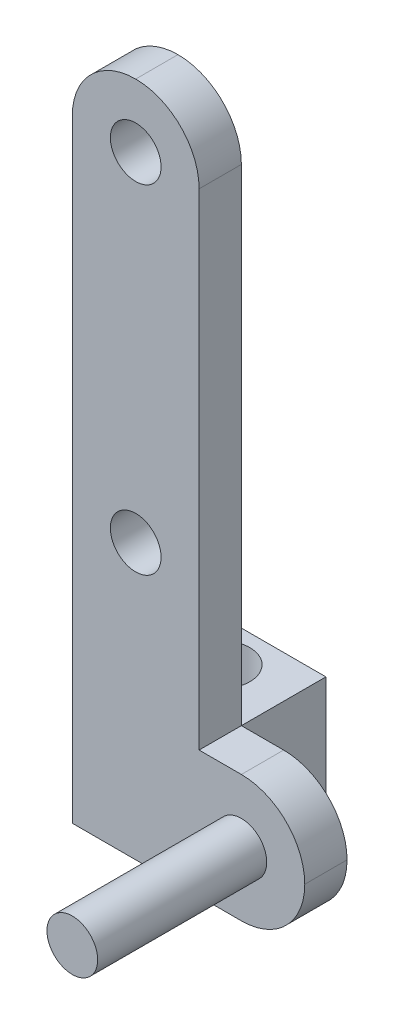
ISO-10303-21;
HEADER;
FILE_DESCRIPTION(('STEP AP214'),'2;1');
FILE_NAME('part.step','',(''),(''),'','','');
FILE_SCHEMA(('AUTOMOTIVE_DESIGN { 1 0 10303 214 1 1 1 1 }'));
ENDSEC;
DATA;
#1=APPLICATION_CONTEXT('core data for automotive mechanical design processes');
#2=APPLICATION_PROTOCOL_DEFINITION('international standard','automotive_design',2000,#1);
#3=PRODUCT_CONTEXT('',#1,'mechanical');
#4=PRODUCT('Part','Part','',(#3));
#5=PRODUCT_RELATED_PRODUCT_CATEGORY('part','',(#4));
#6=PRODUCT_DEFINITION_FORMATION('','',#4);
#7=PRODUCT_DEFINITION_CONTEXT('part definition',#1,'design');
#8=PRODUCT_DEFINITION('design','',#6,#7);
#9=PRODUCT_DEFINITION_SHAPE('','',#8);
#10=(LENGTH_UNIT() NAMED_UNIT(*) SI_UNIT(.MILLI.,.METRE.));
#11=(NAMED_UNIT(*) PLANE_ANGLE_UNIT() SI_UNIT($,.RADIAN.));
#12=(NAMED_UNIT(*) SI_UNIT($,.STERADIAN.) SOLID_ANGLE_UNIT());
#13=UNCERTAINTY_MEASURE_WITH_UNIT(LENGTH_MEASURE(1.E-05),#10,'distance_accuracy_value','');
#14=(GEOMETRIC_REPRESENTATION_CONTEXT(3) GLOBAL_UNCERTAINTY_ASSIGNED_CONTEXT((#13)) GLOBAL_UNIT_ASSIGNED_CONTEXT((#10,
#11,#12)) REPRESENTATION_CONTEXT('',''));
#15=CARTESIAN_POINT('',(0.,0.,0.));
#16=DIRECTION('',(0.,0.,1.));
#17=DIRECTION('',(1.,0.,0.));
#18=AXIS2_PLACEMENT_3D('',#15,#16,#17);
#19=CARTESIAN_POINT('',(-30.,0.,0.));
#20=DIRECTION('',(0.,0.,-1.));
#21=DIRECTION('',(-1.,0.,0.));
#22=AXIS2_PLACEMENT_3D('',#19,#20,#21);
#23=PLANE('',#22);
#24=CARTESIAN_POINT('',(-15.,-95.,0.));
#25=DIRECTION('',(0.,0.,-1.));
#26=DIRECTION('',(-1.,0.,0.));
#27=AXIS2_PLACEMENT_3D('',#24,#25,#26);
#28=CIRCLE('',#27,6.);
#29=CARTESIAN_POINT('',(-21.,-95.,0.));
#30=VERTEX_POINT('',#29);
#31=EDGE_CURVE('E196',#30,#30,#28,.T.);
#32=ORIENTED_EDGE('',*,*,#31,.F.);
#33=EDGE_LOOP('',(#32));
#34=FACE_BOUND('',#33,.T.);
#35=CARTESIAN_POINT('',(-15.,-15.,0.));
#36=DIRECTION('',(0.,0.,-1.));
#37=DIRECTION('',(-1.,0.,0.));
#38=AXIS2_PLACEMENT_3D('',#35,#36,#37);
#39=CIRCLE('',#38,6.);
#40=CARTESIAN_POINT('',(-21.,-15.,0.));
#41=VERTEX_POINT('',#40);
#42=EDGE_CURVE('E202',#41,#41,#39,.T.);
#43=ORIENTED_EDGE('',*,*,#42,.F.);
#44=EDGE_LOOP('',(#43));
#45=FACE_BOUND('',#44,.T.);
#46=DIRECTION('',(0.,-1.,0.));
#47=VECTOR('',#46,1.);
#48=CARTESIAN_POINT('',(-30.,0.,0.));
#49=LINE('',#48,#47);
#50=CARTESIAN_POINT('',(-30.,-15.,0.));
#51=VERTEX_POINT('',#50);
#52=CARTESIAN_POINT('',(-30.,-130.,0.));
#53=VERTEX_POINT('',#52);
#54=EDGE_CURVE('E142',#51,#53,#49,.T.);
#55=ORIENTED_EDGE('',*,*,#54,.F.);
#56=CARTESIAN_POINT('',(-15.,-15.,0.));
#57=DIRECTION('',(0.,0.,-1.));
#58=DIRECTION('',(-1.,0.,0.));
#59=AXIS2_PLACEMENT_3D('',#56,#57,#58);
#60=CIRCLE('',#59,15.);
#61=CARTESIAN_POINT('',(-15.,0.,0.));
#62=VERTEX_POINT('',#61);
#63=EDGE_CURVE('E42',#51,#62,#60,.T.);
#64=ORIENTED_EDGE('',*,*,#63,.T.);
#65=CARTESIAN_POINT('',(-15.,-15.,0.));
#66=DIRECTION('',(0.,0.,-1.));
#67=DIRECTION('',(-1.,0.,0.));
#68=AXIS2_PLACEMENT_3D('',#65,#66,#67);
#69=CIRCLE('',#68,15.);
#70=CARTESIAN_POINT('',(0.,-15.,0.));
#71=VERTEX_POINT('',#70);
#72=EDGE_CURVE('E50',#62,#71,#69,.T.);
#73=ORIENTED_EDGE('',*,*,#72,.T.);
#74=DIRECTION('',(0.,1.,0.));
#75=VECTOR('',#74,1.);
#76=CARTESIAN_POINT('',(0.,0.,0.));
#77=LINE('',#76,#75);
#78=CARTESIAN_POINT('',(0.,-130.,0.));
#79=VERTEX_POINT('',#78);
#80=EDGE_CURVE('E153',#79,#71,#77,.T.);
#81=ORIENTED_EDGE('',*,*,#80,.F.);
#82=DIRECTION('',(1.,0.,0.));
#83=VECTOR('',#82,1.);
#84=CARTESIAN_POINT('',(-30.,-130.,0.));
#85=LINE('',#84,#83);
#86=EDGE_CURVE('E138',#53,#79,#85,.T.);
#87=ORIENTED_EDGE('',*,*,#86,.F.);
#88=EDGE_LOOP('',(#55,#64,#73,#81,#87));
#89=FACE_BOUND('',#88,.T.);
#90=ADVANCED_FACE('F33',(#34,#45,#89),#23,.T.);
#91=CARTESIAN_POINT('',(-30.,0.,10.));
#92=DIRECTION('',(0.,0.,-1.));
#93=DIRECTION('',(-1.,0.,0.));
#94=AXIS2_PLACEMENT_3D('',#91,#92,#93);
#95=PLANE('',#94);
#96=CARTESIAN_POINT('',(-15.,-95.,10.));
#97=DIRECTION('',(0.,0.,1.));
#98=DIRECTION('',(1.,0.,0.));
#99=AXIS2_PLACEMENT_3D('',#96,#97,#98);
#100=CIRCLE('',#99,6.);
#101=CARTESIAN_POINT('',(-8.99999999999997,-95.,10.));
#102=VERTEX_POINT('',#101);
#103=EDGE_CURVE('E179',#102,#102,#100,.T.);
#104=ORIENTED_EDGE('',*,*,#103,.F.);
#105=EDGE_LOOP('',(#104));
#106=FACE_BOUND('',#105,.T.);
#107=CARTESIAN_POINT('',(-15.,-15.,10.));
#108=DIRECTION('',(0.,0.,1.));
#109=DIRECTION('',(1.,0.,0.));
#110=AXIS2_PLACEMENT_3D('',#107,#108,#109);
#111=CIRCLE('',#110,6.);
#112=CARTESIAN_POINT('',(-8.99999999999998,-15.,10.));
#113=VERTEX_POINT('',#112);
#114=EDGE_CURVE('E199',#113,#113,#111,.T.);
#115=ORIENTED_EDGE('',*,*,#114,.F.);
#116=EDGE_LOOP('',(#115));
#117=FACE_BOUND('',#116,.T.);
#118=DIRECTION('',(1.,0.,0.));
#119=VECTOR('',#118,1.);
#120=CARTESIAN_POINT('',(25.,-160.,10.));
#121=LINE('',#120,#119);
#122=CARTESIAN_POINT('',(-30.,-160.,10.));
#123=VERTEX_POINT('',#122);
#124=CARTESIAN_POINT('',(10.,-160.,10.));
#125=VERTEX_POINT('',#124);
#126=EDGE_CURVE('E152',#123,#125,#121,.T.);
#127=ORIENTED_EDGE('',*,*,#126,.T.);
#128=CARTESIAN_POINT('',(10.,-145.,10.));
#129=DIRECTION('',(0.,0.,-1.));
#130=DIRECTION('',(-1.,0.,0.));
#131=AXIS2_PLACEMENT_3D('',#128,#129,#130);
#132=CIRCLE('',#131,15.);
#133=CARTESIAN_POINT('',(25.,-145.,10.));
#134=VERTEX_POINT('',#133);
#135=EDGE_CURVE('E225',#125,#134,#132,.F.);
#136=ORIENTED_EDGE('',*,*,#135,.T.);
#137=CARTESIAN_POINT('',(10.,-145.,10.));
#138=DIRECTION('',(0.,0.,-1.));
#139=DIRECTION('',(-1.,0.,0.));
#140=AXIS2_PLACEMENT_3D('',#137,#138,#139);
#141=CIRCLE('',#140,15.);
#142=CARTESIAN_POINT('',(10.,-130.,10.));
#143=VERTEX_POINT('',#142);
#144=EDGE_CURVE('E224',#134,#143,#141,.F.);
#145=ORIENTED_EDGE('',*,*,#144,.T.);
#146=DIRECTION('',(-1.,0.,0.));
#147=VECTOR('',#146,1.);
#148=CARTESIAN_POINT('',(0.,-130.,10.));
#149=LINE('',#148,#147);
#150=CARTESIAN_POINT('',(0.,-130.,10.));
#151=VERTEX_POINT('',#150);
#152=EDGE_CURVE('E156',#143,#151,#149,.T.);
#153=ORIENTED_EDGE('',*,*,#152,.T.);
#154=DIRECTION('',(0.,1.,0.));
#155=VECTOR('',#154,1.);
#156=CARTESIAN_POINT('',(0.,0.,10.));
#157=LINE('',#156,#155);
#158=CARTESIAN_POINT('',(0.,-15.,10.));
#159=VERTEX_POINT('',#158);
#160=EDGE_CURVE('E158',#151,#159,#157,.T.);
#161=ORIENTED_EDGE('',*,*,#160,.T.);
#162=CARTESIAN_POINT('',(-15.,-15.,10.));
#163=DIRECTION('',(0.,0.,-1.));
#164=DIRECTION('',(-1.,0.,0.));
#165=AXIS2_PLACEMENT_3D('',#162,#163,#164);
#166=CIRCLE('',#165,15.);
#167=CARTESIAN_POINT('',(-15.,0.,10.));
#168=VERTEX_POINT('',#167);
#169=EDGE_CURVE('E220',#159,#168,#166,.F.);
#170=ORIENTED_EDGE('',*,*,#169,.T.);
#171=CARTESIAN_POINT('',(-15.,-15.,10.));
#172=DIRECTION('',(0.,0.,-1.));
#173=DIRECTION('',(-1.,0.,0.));
#174=AXIS2_PLACEMENT_3D('',#171,#172,#173);
#175=CIRCLE('',#174,15.);
#176=CARTESIAN_POINT('',(-30.,-15.,10.));
#177=VERTEX_POINT('',#176);
#178=EDGE_CURVE('E222',#168,#177,#175,.F.);
#179=ORIENTED_EDGE('',*,*,#178,.T.);
#180=DIRECTION('',(0.,-1.,0.));
#181=VECTOR('',#180,1.);
#182=CARTESIAN_POINT('',(-30.,0.,10.));
#183=LINE('',#182,#181);
#184=EDGE_CURVE('E150',#177,#123,#183,.T.);
#185=ORIENTED_EDGE('',*,*,#184,.T.);
#186=EDGE_LOOP('',(#127,#136,#145,#153,#161,#170,#179,#185));
#187=FACE_BOUND('',#186,.T.);
#188=CARTESIAN_POINT('',(10.,-145.,10.));
#189=DIRECTION('',(0.,0.,-1.));
#190=DIRECTION('',(-1.,0.,0.));
#191=AXIS2_PLACEMENT_3D('',#188,#189,#190);
#192=CIRCLE('',#191,6.);
#193=CARTESIAN_POINT('',(4.00000000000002,-145.,10.));
#194=VERTEX_POINT('',#193);
#195=EDGE_CURVE('E215',#194,#194,#192,.F.);
#196=ORIENTED_EDGE('',*,*,#195,.F.);
#197=EDGE_LOOP('',(#196));
#198=FACE_BOUND('',#197,.T.);
#199=ADVANCED_FACE('F267',(#106,#117,#187,#198),#95,.F.);
#200=CARTESIAN_POINT('',(-30.,0.,10.));
#201=DIRECTION('',(1.,0.,0.));
#202=DIRECTION('',(0.,1.,0.));
#203=AXIS2_PLACEMENT_3D('',#200,#201,#202);
#204=PLANE('',#203);
#205=ORIENTED_EDGE('',*,*,#184,.F.);
#206=DIRECTION('',(0.,0.,-1.));
#207=VECTOR('',#206,1.);
#208=CARTESIAN_POINT('',(-30.,-15.,10.));
#209=LINE('',#208,#207);
#210=EDGE_CURVE('E172',#177,#51,#209,.T.);
#211=ORIENTED_EDGE('',*,*,#210,.T.);
#212=ORIENTED_EDGE('',*,*,#54,.T.);
#213=DIRECTION('',(0.,0.,1.));
#214=VECTOR('',#213,1.);
#215=CARTESIAN_POINT('',(-30.,-130.,-20.));
#216=LINE('',#215,#214);
#217=CARTESIAN_POINT('',(-30.,-130.,-20.));
#218=VERTEX_POINT('',#217);
#219=EDGE_CURVE('E144',#218,#53,#216,.T.);
#220=ORIENTED_EDGE('',*,*,#219,.F.);
#221=DIRECTION('',(0.,1.,0.));
#222=VECTOR('',#221,1.);
#223=CARTESIAN_POINT('',(-30.,-160.,-20.));
#224=LINE('',#223,#222);
#225=CARTESIAN_POINT('',(-30.,-160.,-20.));
#226=VERTEX_POINT('',#225);
#227=EDGE_CURVE('E130',#226,#218,#224,.T.);
#228=ORIENTED_EDGE('',*,*,#227,.F.);
#229=DIRECTION('',(0.,0.,-1.));
#230=VECTOR('',#229,1.);
#231=CARTESIAN_POINT('',(-30.,-160.,10.));
#232=LINE('',#231,#230);
#233=EDGE_CURVE('E258',#123,#226,#232,.T.);
#234=ORIENTED_EDGE('',*,*,#233,.F.);
#235=EDGE_LOOP('',(#205,#211,#212,#220,#228,#234));
#236=FACE_BOUND('',#235,.T.);
#237=ADVANCED_FACE('F273',(#236),#204,.F.);
#238=CARTESIAN_POINT('',(25.,-160.,10.));
#239=DIRECTION('',(0.,1.,0.));
#240=DIRECTION('',(0.,0.,1.));
#241=AXIS2_PLACEMENT_3D('',#238,#239,#240);
#242=PLANE('',#241);
#243=CARTESIAN_POINT('',(-15.,-160.,-10.));
#244=DIRECTION('',(0.,1.,0.));
#245=DIRECTION('',(0.,0.,1.));
#246=AXIS2_PLACEMENT_3D('',#243,#244,#245);
#247=CIRCLE('',#246,6.99999999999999);
#248=CARTESIAN_POINT('',(-15.,-160.,-3.00000000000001));
#249=VERTEX_POINT('',#248);
#250=EDGE_CURVE('E37',#249,#249,#247,.T.);
#251=ORIENTED_EDGE('',*,*,#250,.T.);
#252=EDGE_LOOP('',(#251));
#253=FACE_BOUND('',#252,.T.);
#254=DIRECTION('',(1.,0.,0.));
#255=VECTOR('',#254,1.);
#256=CARTESIAN_POINT('',(25.,-160.,0.));
#257=LINE('',#256,#255);
#258=CARTESIAN_POINT('',(0.,-160.,0.));
#259=VERTEX_POINT('',#258);
#260=CARTESIAN_POINT('',(10.,-160.,0.));
#261=VERTEX_POINT('',#260);
#262=EDGE_CURVE('E169',#259,#261,#257,.T.);
#263=ORIENTED_EDGE('',*,*,#262,.T.);
#264=DIRECTION('',(0.,0.,-1.));
#265=VECTOR('',#264,1.);
#266=CARTESIAN_POINT('',(10.,-160.,10.));
#267=LINE('',#266,#265);
#268=EDGE_CURVE('E217',#261,#125,#267,.F.);
#269=ORIENTED_EDGE('',*,*,#268,.T.);
#270=ORIENTED_EDGE('',*,*,#126,.F.);
#271=ORIENTED_EDGE('',*,*,#233,.T.);
#272=DIRECTION('',(-1.,0.,0.));
#273=VECTOR('',#272,1.);
#274=CARTESIAN_POINT('',(0.,-160.,-20.));
#275=LINE('',#274,#273);
#276=CARTESIAN_POINT('',(0.,-160.,-20.));
#277=VERTEX_POINT('',#276);
#278=EDGE_CURVE('E124',#277,#226,#275,.T.);
#279=ORIENTED_EDGE('',*,*,#278,.F.);
#280=DIRECTION('',(0.,0.,1.));
#281=VECTOR('',#280,1.);
#282=CARTESIAN_POINT('',(0.,-160.,-20.));
#283=LINE('',#282,#281);
#284=EDGE_CURVE('E120',#277,#259,#283,.T.);
#285=ORIENTED_EDGE('',*,*,#284,.T.);
#286=EDGE_LOOP('',(#263,#269,#270,#271,#279,#285));
#287=FACE_BOUND('',#286,.T.);
#288=ADVANCED_FACE('F249',(#253,#287),#242,.F.);
#289=CARTESIAN_POINT('',(0.,-130.,10.));
#290=DIRECTION('',(0.,-1.,0.));
#291=DIRECTION('',(0.,0.,-1.));
#292=AXIS2_PLACEMENT_3D('',#289,#290,#291);
#293=PLANE('',#292);
#294=ORIENTED_EDGE('',*,*,#152,.F.);
#295=DIRECTION('',(0.,0.,-1.));
#296=VECTOR('',#295,1.);
#297=CARTESIAN_POINT('',(10.,-130.,10.));
#298=LINE('',#297,#296);
#299=CARTESIAN_POINT('',(10.,-130.,0.));
#300=VERTEX_POINT('',#299);
#301=EDGE_CURVE('E170',#143,#300,#298,.T.);
#302=ORIENTED_EDGE('',*,*,#301,.T.);
#303=DIRECTION('',(-1.,0.,0.));
#304=VECTOR('',#303,1.);
#305=CARTESIAN_POINT('',(0.,-130.,0.));
#306=LINE('',#305,#304);
#307=EDGE_CURVE('E234',#300,#79,#306,.T.);
#308=ORIENTED_EDGE('',*,*,#307,.T.);
#309=DIRECTION('',(0.,0.,-1.));
#310=VECTOR('',#309,1.);
#311=CARTESIAN_POINT('',(0.,-130.,10.));
#312=LINE('',#311,#310);
#313=EDGE_CURVE('E161',#151,#79,#312,.T.);
#314=ORIENTED_EDGE('',*,*,#313,.F.);
#315=EDGE_LOOP('',(#294,#302,#308,#314));
#316=FACE_BOUND('',#315,.T.);
#317=ADVANCED_FACE('F232',(#316),#293,.F.);
#318=CARTESIAN_POINT('',(0.,0.,10.));
#319=DIRECTION('',(-1.,0.,0.));
#320=DIRECTION('',(0.,-1.,0.));
#321=AXIS2_PLACEMENT_3D('',#318,#319,#320);
#322=PLANE('',#321);
#323=ORIENTED_EDGE('',*,*,#80,.T.);
#324=DIRECTION('',(0.,0.,-1.));
#325=VECTOR('',#324,1.);
#326=CARTESIAN_POINT('',(0.,-15.,10.));
#327=LINE('',#326,#325);
#328=EDGE_CURVE('E11',#71,#159,#327,.F.);
#329=ORIENTED_EDGE('',*,*,#328,.T.);
#330=ORIENTED_EDGE('',*,*,#160,.F.);
#331=ORIENTED_EDGE('',*,*,#313,.T.);
#332=EDGE_LOOP('',(#323,#329,#330,#331));
#333=FACE_BOUND('',#332,.T.);
#334=ADVANCED_FACE('F263',(#333),#322,.F.);
#335=CARTESIAN_POINT('',(10.,-145.,0.));
#336=DIRECTION('',(0.,0.,-1.));
#337=DIRECTION('',(-1.,0.,0.));
#338=AXIS2_PLACEMENT_3D('',#335,#336,#337);
#339=CIRCLE('',#338,15.);
#340=CARTESIAN_POINT('',(25.,-145.,0.));
#341=VERTEX_POINT('',#340);
#342=EDGE_CURVE('E212',#300,#341,#339,.T.);
#343=ORIENTED_EDGE('',*,*,#342,.T.);
#344=CARTESIAN_POINT('',(10.,-145.,0.));
#345=DIRECTION('',(0.,0.,-1.));
#346=DIRECTION('',(-1.,0.,0.));
#347=AXIS2_PLACEMENT_3D('',#344,#345,#346);
#348=CIRCLE('',#347,15.);
#349=EDGE_CURVE('E214',#341,#261,#348,.T.);
#350=ORIENTED_EDGE('',*,*,#349,.T.);
#351=ORIENTED_EDGE('',*,*,#262,.F.);
#352=DIRECTION('',(0.,-1.,0.));
#353=VECTOR('',#352,1.);
#354=CARTESIAN_POINT('',(0.,-130.,0.));
#355=LINE('',#354,#353);
#356=EDGE_CURVE('E134',#79,#259,#355,.T.);
#357=ORIENTED_EDGE('',*,*,#356,.F.);
#358=ORIENTED_EDGE('',*,*,#307,.F.);
#359=EDGE_LOOP('',(#343,#350,#351,#357,#358));
#360=FACE_BOUND('',#359,.T.);
#361=ADVANCED_FACE('F239',(#360),#23,.T.);
#362=CARTESIAN_POINT('',(10.,-145.,50.));
#363=DIRECTION('',(0.,0.,-1.));
#364=DIRECTION('',(-1.,0.,0.));
#365=AXIS2_PLACEMENT_3D('',#362,#363,#364);
#366=CYLINDRICAL_SURFACE('',#365,6.);
#367=CARTESIAN_POINT('',(10.,-145.,50.));
#368=DIRECTION('',(0.,0.,1.));
#369=DIRECTION('',(1.,0.,0.));
#370=AXIS2_PLACEMENT_3D('',#367,#368,#369);
#371=CIRCLE('',#370,6.);
#372=CARTESIAN_POINT('',(16.,-145.,50.));
#373=VERTEX_POINT('',#372);
#374=EDGE_CURVE('E139',#373,#373,#371,.T.);
#375=ORIENTED_EDGE('',*,*,#374,.F.);
#376=EDGE_LOOP('',(#375));
#377=FACE_BOUND('',#376,.T.);
#378=ORIENTED_EDGE('',*,*,#195,.T.);
#379=EDGE_LOOP('',(#378));
#380=FACE_BOUND('',#379,.T.);
#381=ADVANCED_FACE('F295',(#377,#380),#366,.T.);
#382=CARTESIAN_POINT('',(10.,-145.,50.));
#383=DIRECTION('',(0.,0.,1.));
#384=DIRECTION('',(1.,0.,0.));
#385=AXIS2_PLACEMENT_3D('',#382,#383,#384);
#386=PLANE('',#385);
#387=ORIENTED_EDGE('',*,*,#374,.T.);
#388=EDGE_LOOP('',(#387));
#389=FACE_BOUND('',#388,.T.);
#390=ADVANCED_FACE('F300',(#389),#386,.T.);
#391=CARTESIAN_POINT('',(-30.,-130.,-20.));
#392=DIRECTION('',(0.,-1.,0.));
#393=DIRECTION('',(0.,0.,-1.));
#394=AXIS2_PLACEMENT_3D('',#391,#392,#393);
#395=PLANE('',#394);
#396=CARTESIAN_POINT('',(-15.,-130.,-10.));
#397=DIRECTION('',(0.,1.,0.));
#398=DIRECTION('',(0.,0.,1.));
#399=AXIS2_PLACEMENT_3D('',#396,#397,#398);
#400=CIRCLE('',#399,6.99999999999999);
#401=CARTESIAN_POINT('',(-15.,-130.,-3.00000000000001));
#402=VERTEX_POINT('',#401);
#403=EDGE_CURVE('E186',#402,#402,#400,.T.);
#404=ORIENTED_EDGE('',*,*,#403,.F.);
#405=EDGE_LOOP('',(#404));
#406=FACE_BOUND('',#405,.T.);
#407=ORIENTED_EDGE('',*,*,#86,.T.);
#408=DIRECTION('',(0.,0.,1.));
#409=VECTOR('',#408,1.);
#410=CARTESIAN_POINT('',(0.,-130.,-20.));
#411=LINE('',#410,#409);
#412=CARTESIAN_POINT('',(0.,-130.,-20.));
#413=VERTEX_POINT('',#412);
#414=EDGE_CURVE('E117',#413,#79,#411,.T.);
#415=ORIENTED_EDGE('',*,*,#414,.F.);
#416=DIRECTION('',(1.,0.,0.));
#417=VECTOR('',#416,1.);
#418=CARTESIAN_POINT('',(-30.,-130.,-20.));
#419=LINE('',#418,#417);
#420=EDGE_CURVE('E125',#218,#413,#419,.T.);
#421=ORIENTED_EDGE('',*,*,#420,.F.);
#422=ORIENTED_EDGE('',*,*,#219,.T.);
#423=EDGE_LOOP('',(#407,#415,#421,#422));
#424=FACE_BOUND('',#423,.T.);
#425=ADVANCED_FACE('F136',(#406,#424),#395,.F.);
#426=CARTESIAN_POINT('',(0.,-130.,-20.));
#427=DIRECTION('',(-1.,0.,0.));
#428=DIRECTION('',(0.,-1.,0.));
#429=AXIS2_PLACEMENT_3D('',#426,#427,#428);
#430=PLANE('',#429);
#431=ORIENTED_EDGE('',*,*,#356,.T.);
#432=ORIENTED_EDGE('',*,*,#284,.F.);
#433=DIRECTION('',(0.,-1.,0.));
#434=VECTOR('',#433,1.);
#435=CARTESIAN_POINT('',(0.,-130.,-20.));
#436=LINE('',#435,#434);
#437=EDGE_CURVE('E112',#413,#277,#436,.T.);
#438=ORIENTED_EDGE('',*,*,#437,.F.);
#439=ORIENTED_EDGE('',*,*,#414,.T.);
#440=EDGE_LOOP('',(#431,#432,#438,#439));
#441=FACE_BOUND('',#440,.T.);
#442=ADVANCED_FACE('F115',(#441),#430,.F.);
#443=CARTESIAN_POINT('',(0.,-130.,-20.));
#444=DIRECTION('',(0.,0.,-1.));
#445=DIRECTION('',(-1.,0.,0.));
#446=AXIS2_PLACEMENT_3D('',#443,#444,#445);
#447=PLANE('',#446);
#448=ORIENTED_EDGE('',*,*,#420,.T.);
#449=ORIENTED_EDGE('',*,*,#437,.T.);
#450=ORIENTED_EDGE('',*,*,#278,.T.);
#451=ORIENTED_EDGE('',*,*,#227,.T.);
#452=EDGE_LOOP('',(#448,#449,#450,#451));
#453=FACE_BOUND('',#452,.T.);
#454=ADVANCED_FACE('F128',(#453),#447,.T.);
#455=CARTESIAN_POINT('',(-15.,-15.,-20.000025));
#456=DIRECTION('',(0.,0.,1.));
#457=DIRECTION('',(1.,0.,0.));
#458=AXIS2_PLACEMENT_3D('',#455,#456,#457);
#459=CYLINDRICAL_SURFACE('',#458,6.);
#460=ORIENTED_EDGE('',*,*,#42,.T.);
#461=EDGE_LOOP('',(#460));
#462=FACE_BOUND('',#461,.T.);
#463=ORIENTED_EDGE('',*,*,#114,.T.);
#464=EDGE_LOOP('',(#463));
#465=FACE_BOUND('',#464,.T.);
#466=ADVANCED_FACE('F318',(#462,#465),#459,.F.);
#467=CARTESIAN_POINT('',(-15.,-95.,-20.000025));
#468=DIRECTION('',(0.,0.,1.));
#469=DIRECTION('',(1.,0.,0.));
#470=AXIS2_PLACEMENT_3D('',#467,#468,#469);
#471=CYLINDRICAL_SURFACE('',#470,6.);
#472=ORIENTED_EDGE('',*,*,#31,.T.);
#473=EDGE_LOOP('',(#472));
#474=FACE_BOUND('',#473,.T.);
#475=ORIENTED_EDGE('',*,*,#103,.T.);
#476=EDGE_LOOP('',(#475));
#477=FACE_BOUND('',#476,.T.);
#478=ADVANCED_FACE('F314',(#474,#477),#471,.F.);
#479=CARTESIAN_POINT('',(10.,-145.,10.));
#480=DIRECTION('',(0.,0.,-1.));
#481=DIRECTION('',(-1.,0.,0.));
#482=AXIS2_PLACEMENT_3D('',#479,#480,#481);
#483=CYLINDRICAL_SURFACE('',#482,15.);
#484=ORIENTED_EDGE('',*,*,#301,.F.);
#485=ORIENTED_EDGE('',*,*,#144,.F.);
#486=DIRECTION('',(0.,0.,-1.));
#487=VECTOR('',#486,1.);
#488=CARTESIAN_POINT('',(25.,-145.,10.));
#489=LINE('',#488,#487);
#490=EDGE_CURVE('E177',#341,#134,#489,.F.);
#491=ORIENTED_EDGE('',*,*,#490,.F.);
#492=ORIENTED_EDGE('',*,*,#342,.F.);
#493=EDGE_LOOP('',(#484,#485,#491,#492));
#494=FACE_BOUND('',#493,.T.);
#495=ADVANCED_FACE('F242',(#494),#483,.T.);
#496=CARTESIAN_POINT('',(10.,-145.,10.));
#497=DIRECTION('',(0.,0.,-1.));
#498=DIRECTION('',(-1.,0.,0.));
#499=AXIS2_PLACEMENT_3D('',#496,#497,#498);
#500=CYLINDRICAL_SURFACE('',#499,15.);
#501=ORIENTED_EDGE('',*,*,#135,.F.);
#502=ORIENTED_EDGE('',*,*,#268,.F.);
#503=ORIENTED_EDGE('',*,*,#349,.F.);
#504=ORIENTED_EDGE('',*,*,#490,.T.);
#505=EDGE_LOOP('',(#501,#502,#503,#504));
#506=FACE_BOUND('',#505,.T.);
#507=ADVANCED_FACE('F246',(#506),#500,.T.);
#508=CARTESIAN_POINT('',(-15.,-15.,10.));
#509=DIRECTION('',(0.,0.,-1.));
#510=DIRECTION('',(-1.,0.,0.));
#511=AXIS2_PLACEMENT_3D('',#508,#509,#510);
#512=CYLINDRICAL_SURFACE('',#511,15.);
#513=DIRECTION('',(0.,0.,-1.));
#514=VECTOR('',#513,1.);
#515=CARTESIAN_POINT('',(-15.,0.,10.));
#516=LINE('',#515,#514);
#517=EDGE_CURVE('E180',#168,#62,#516,.T.);
#518=ORIENTED_EDGE('',*,*,#517,.F.);
#519=ORIENTED_EDGE('',*,*,#169,.F.);
#520=ORIENTED_EDGE('',*,*,#328,.F.);
#521=ORIENTED_EDGE('',*,*,#72,.F.);
#522=EDGE_LOOP('',(#518,#519,#520,#521));
#523=FACE_BOUND('',#522,.T.);
#524=ADVANCED_FACE('F35',(#523),#512,.T.);
#525=CARTESIAN_POINT('',(-15.,-15.,10.));
#526=DIRECTION('',(0.,0.,-1.));
#527=DIRECTION('',(-1.,0.,0.));
#528=AXIS2_PLACEMENT_3D('',#525,#526,#527);
#529=CYLINDRICAL_SURFACE('',#528,15.);
#530=ORIENTED_EDGE('',*,*,#178,.F.);
#531=ORIENTED_EDGE('',*,*,#517,.T.);
#532=ORIENTED_EDGE('',*,*,#63,.F.);
#533=ORIENTED_EDGE('',*,*,#210,.F.);
#534=EDGE_LOOP('',(#530,#531,#532,#533));
#535=FACE_BOUND('',#534,.T.);
#536=ADVANCED_FACE('F274',(#535),#529,.T.);
#537=CARTESIAN_POINT('',(-15.,-130.,-10.));
#538=DIRECTION('',(0.,1.,0.));
#539=DIRECTION('',(0.,0.,1.));
#540=AXIS2_PLACEMENT_3D('',#537,#538,#539);
#541=CYLINDRICAL_SURFACE('',#540,6.99999999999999);
#542=ORIENTED_EDGE('',*,*,#403,.T.);
#543=EDGE_LOOP('',(#542));
#544=FACE_BOUND('',#543,.T.);
#545=ORIENTED_EDGE('',*,*,#250,.F.);
#546=EDGE_LOOP('',(#545));
#547=FACE_BOUND('',#546,.T.);
#548=ADVANCED_FACE('F276',(#544,#547),#541,.F.);
#549=CLOSED_SHELL('',(#90,#199,#237,#288,#317,#334,#361,#381,#390,#425,#442,#454,#466,#478,#495,
#507,#524,#536,#548));
#550=MANIFOLD_SOLID_BREP('B2',#549);
#551=ADVANCED_BREP_SHAPE_REPRESENTATION('',(#18,#550),#14);
#552=SHAPE_DEFINITION_REPRESENTATION(#9,#551);
ENDSEC;
END-ISO-10303-21;
